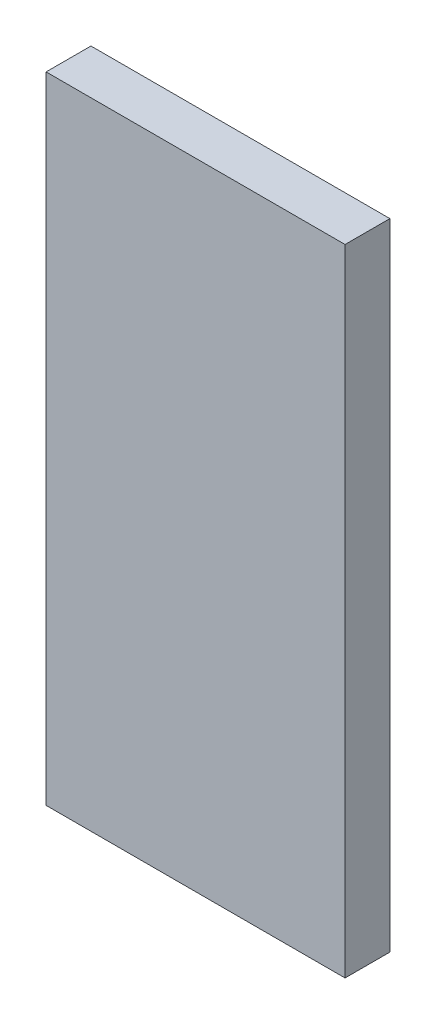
ISO-10303-21;
HEADER;
FILE_DESCRIPTION(('STEP AP214'),'2;1');
FILE_NAME('part.step','',(''),(''),'','','');
FILE_SCHEMA(('AUTOMOTIVE_DESIGN { 1 0 10303 214 1 1 1 1 }'));
ENDSEC;
DATA;
#1=APPLICATION_CONTEXT('core data for automotive mechanical design processes');
#2=APPLICATION_PROTOCOL_DEFINITION('international standard','automotive_design',2000,#1);
#3=PRODUCT_CONTEXT('',#1,'mechanical');
#4=PRODUCT('Part','Part','',(#3));
#5=PRODUCT_RELATED_PRODUCT_CATEGORY('part','',(#4));
#6=PRODUCT_DEFINITION_FORMATION('','',#4);
#7=PRODUCT_DEFINITION_CONTEXT('part definition',#1,'design');
#8=PRODUCT_DEFINITION('design','',#6,#7);
#9=PRODUCT_DEFINITION_SHAPE('','',#8);
#10=(LENGTH_UNIT() NAMED_UNIT(*) SI_UNIT(.MILLI.,.METRE.));
#11=(NAMED_UNIT(*) PLANE_ANGLE_UNIT() SI_UNIT($,.RADIAN.));
#12=(NAMED_UNIT(*) SI_UNIT($,.STERADIAN.) SOLID_ANGLE_UNIT());
#13=UNCERTAINTY_MEASURE_WITH_UNIT(LENGTH_MEASURE(1.E-05),#10,'distance_accuracy_value','');
#14=(GEOMETRIC_REPRESENTATION_CONTEXT(3) GLOBAL_UNCERTAINTY_ASSIGNED_CONTEXT((#13)) GLOBAL_UNIT_ASSIGNED_CONTEXT((#10,
#11,#12)) REPRESENTATION_CONTEXT('',''));
#15=CARTESIAN_POINT('',(0.,0.,0.));
#16=DIRECTION('',(0.,0.,1.));
#17=DIRECTION('',(1.,0.,0.));
#18=AXIS2_PLACEMENT_3D('',#15,#16,#17);
#19=CARTESIAN_POINT('',(0.,0.,0.06));
#20=DIRECTION('',(0.,0.,1.));
#21=DIRECTION('',(1.,0.,0.));
#22=AXIS2_PLACEMENT_3D('',#19,#20,#21);
#23=PLANE('',#22);
#24=DIRECTION('',(0.,1.,0.));
#25=VECTOR('',#24,1.);
#26=CARTESIAN_POINT('',(0.,0.,0.06));
#27=LINE('',#26,#25);
#28=CARTESIAN_POINT('',(0.,0.,0.06));
#29=VERTEX_POINT('',#28);
#30=CARTESIAN_POINT('',(0.,0.85,0.06));
#31=VERTEX_POINT('',#30);
#32=EDGE_CURVE('E76',#29,#31,#27,.T.);
#33=ORIENTED_EDGE('',*,*,#32,.F.);
#34=DIRECTION('',(1.,0.,0.));
#35=VECTOR('',#34,1.);
#36=CARTESIAN_POINT('',(0.,0.,0.06));
#37=LINE('',#36,#35);
#38=CARTESIAN_POINT('',(0.4,0.,0.06));
#39=VERTEX_POINT('',#38);
#40=EDGE_CURVE('E71',#29,#39,#37,.T.);
#41=ORIENTED_EDGE('',*,*,#40,.T.);
#42=DIRECTION('',(0.,1.,0.));
#43=VECTOR('',#42,1.);
#44=CARTESIAN_POINT('',(0.4,0.,0.06));
#45=LINE('',#44,#43);
#46=CARTESIAN_POINT('',(0.4,0.85,0.06));
#47=VERTEX_POINT('',#46);
#48=EDGE_CURVE('E73',#39,#47,#45,.T.);
#49=ORIENTED_EDGE('',*,*,#48,.T.);
#50=DIRECTION('',(1.,0.,0.));
#51=VECTOR('',#50,1.);
#52=CARTESIAN_POINT('',(0.,0.85,0.06));
#53=LINE('',#52,#51);
#54=EDGE_CURVE('E11',#31,#47,#53,.T.);
#55=ORIENTED_EDGE('',*,*,#54,.F.);
#56=EDGE_LOOP('',(#33,#41,#49,#55));
#57=FACE_BOUND('',#56,.T.);
#58=ADVANCED_FACE('F17',(#57),#23,.T.);
#59=CARTESIAN_POINT('',(0.,0.,0.));
#60=DIRECTION('',(0.,0.,1.));
#61=DIRECTION('',(1.,0.,0.));
#62=AXIS2_PLACEMENT_3D('',#59,#60,#61);
#63=PLANE('',#62);
#64=DIRECTION('',(1.,0.,0.));
#65=VECTOR('',#64,1.);
#66=CARTESIAN_POINT('',(0.,0.85,0.));
#67=LINE('',#66,#65);
#68=CARTESIAN_POINT('',(0.,0.85,0.));
#69=VERTEX_POINT('',#68);
#70=CARTESIAN_POINT('',(0.4,0.85,0.));
#71=VERTEX_POINT('',#70);
#72=EDGE_CURVE('E20',#69,#71,#67,.T.);
#73=ORIENTED_EDGE('',*,*,#72,.T.);
#74=DIRECTION('',(0.,1.,0.));
#75=VECTOR('',#74,1.);
#76=CARTESIAN_POINT('',(0.4,0.,0.));
#77=LINE('',#76,#75);
#78=CARTESIAN_POINT('',(0.4,0.,0.));
#79=VERTEX_POINT('',#78);
#80=EDGE_CURVE('E89',#79,#71,#77,.T.);
#81=ORIENTED_EDGE('',*,*,#80,.F.);
#82=DIRECTION('',(1.,0.,0.));
#83=VECTOR('',#82,1.);
#84=CARTESIAN_POINT('',(0.,0.,0.));
#85=LINE('',#84,#83);
#86=CARTESIAN_POINT('',(0.,0.,0.));
#87=VERTEX_POINT('',#86);
#88=EDGE_CURVE('E63',#87,#79,#85,.T.);
#89=ORIENTED_EDGE('',*,*,#88,.F.);
#90=DIRECTION('',(0.,1.,0.));
#91=VECTOR('',#90,1.);
#92=CARTESIAN_POINT('',(0.,0.,0.));
#93=LINE('',#92,#91);
#94=EDGE_CURVE('E98',#87,#69,#93,.T.);
#95=ORIENTED_EDGE('',*,*,#94,.T.);
#96=EDGE_LOOP('',(#73,#81,#89,#95));
#97=FACE_BOUND('',#96,.T.);
#98=ADVANCED_FACE('F159',(#97),#63,.F.);
#99=CARTESIAN_POINT('',(0.,0.85,0.));
#100=DIRECTION('',(0.,1.,0.));
#101=DIRECTION('',(1.,0.,0.));
#102=AXIS2_PLACEMENT_3D('',#99,#100,#101);
#103=PLANE('',#102);
#104=ORIENTED_EDGE('',*,*,#72,.F.);
#105=DIRECTION('',(0.,0.,1.));
#106=VECTOR('',#105,1.);
#107=CARTESIAN_POINT('',(0.,0.85,0.));
#108=LINE('',#107,#106);
#109=EDGE_CURVE('E146',#69,#31,#108,.T.);
#110=ORIENTED_EDGE('',*,*,#109,.T.);
#111=ORIENTED_EDGE('',*,*,#54,.T.);
#112=DIRECTION('',(0.,0.,1.));
#113=VECTOR('',#112,1.);
#114=CARTESIAN_POINT('',(0.4,0.85,0.));
#115=LINE('',#114,#113);
#116=EDGE_CURVE('E84',#71,#47,#115,.T.);
#117=ORIENTED_EDGE('',*,*,#116,.F.);
#118=EDGE_LOOP('',(#104,#110,#111,#117));
#119=FACE_BOUND('',#118,.T.);
#120=ADVANCED_FACE('F161',(#119),#103,.T.);
#121=CARTESIAN_POINT('',(0.,0.,0.));
#122=DIRECTION('',(0.,1.,0.));
#123=DIRECTION('',(1.,0.,0.));
#124=AXIS2_PLACEMENT_3D('',#121,#122,#123);
#125=PLANE('',#124);
#126=DIRECTION('',(0.,0.,1.));
#127=VECTOR('',#126,1.);
#128=CARTESIAN_POINT('',(0.4,0.,0.));
#129=LINE('',#128,#127);
#130=EDGE_CURVE('E83',#79,#39,#129,.T.);
#131=ORIENTED_EDGE('',*,*,#130,.T.);
#132=ORIENTED_EDGE('',*,*,#40,.F.);
#133=DIRECTION('',(0.,0.,1.));
#134=VECTOR('',#133,1.);
#135=CARTESIAN_POINT('',(0.,0.,0.));
#136=LINE('',#135,#134);
#137=EDGE_CURVE('E90',#87,#29,#136,.T.);
#138=ORIENTED_EDGE('',*,*,#137,.F.);
#139=ORIENTED_EDGE('',*,*,#88,.T.);
#140=EDGE_LOOP('',(#131,#132,#138,#139));
#141=FACE_BOUND('',#140,.T.);
#142=ADVANCED_FACE('F87',(#141),#125,.F.);
#143=CARTESIAN_POINT('',(0.4,0.,0.));
#144=DIRECTION('',(1.,0.,0.));
#145=DIRECTION('',(0.,1.,0.));
#146=AXIS2_PLACEMENT_3D('',#143,#144,#145);
#147=PLANE('',#146);
#148=ORIENTED_EDGE('',*,*,#130,.F.);
#149=ORIENTED_EDGE('',*,*,#80,.T.);
#150=ORIENTED_EDGE('',*,*,#116,.T.);
#151=ORIENTED_EDGE('',*,*,#48,.F.);
#152=EDGE_LOOP('',(#148,#149,#150,#151));
#153=FACE_BOUND('',#152,.T.);
#154=ADVANCED_FACE('F81',(#153),#147,.T.);
#155=CARTESIAN_POINT('',(0.,0.,0.));
#156=DIRECTION('',(1.,0.,0.));
#157=DIRECTION('',(0.,1.,0.));
#158=AXIS2_PLACEMENT_3D('',#155,#156,#157);
#159=PLANE('',#158);
#160=ORIENTED_EDGE('',*,*,#32,.T.);
#161=ORIENTED_EDGE('',*,*,#109,.F.);
#162=ORIENTED_EDGE('',*,*,#94,.F.);
#163=ORIENTED_EDGE('',*,*,#137,.T.);
#164=EDGE_LOOP('',(#160,#161,#162,#163));
#165=FACE_BOUND('',#164,.T.);
#166=ADVANCED_FACE('F126',(#165),#159,.F.);
#167=CLOSED_SHELL('',(#58,#98,#120,#142,#154,#166));
#168=MANIFOLD_SOLID_BREP('B1',#167);
#169=ADVANCED_BREP_SHAPE_REPRESENTATION('',(#18,#168),#14);
#170=SHAPE_DEFINITION_REPRESENTATION(#9,#169);
ENDSEC;
END-ISO-10303-21;
